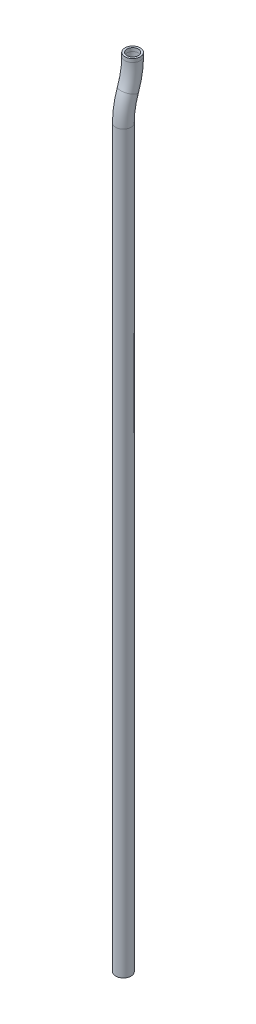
ISO-10303-21;
HEADER;
FILE_DESCRIPTION(('STEP AP214'),'2;1');
FILE_NAME('part.step','',(''),(''),'','','');
FILE_SCHEMA(('AUTOMOTIVE_DESIGN { 1 0 10303 214 1 1 1 1 }'));
ENDSEC;
DATA;
#1=APPLICATION_CONTEXT('core data for automotive mechanical design processes');
#2=APPLICATION_PROTOCOL_DEFINITION('international standard','automotive_design',2000,#1);
#3=PRODUCT_CONTEXT('',#1,'mechanical');
#4=PRODUCT('Part','Part','',(#3));
#5=PRODUCT_RELATED_PRODUCT_CATEGORY('part','',(#4));
#6=PRODUCT_DEFINITION_FORMATION('','',#4);
#7=PRODUCT_DEFINITION_CONTEXT('part definition',#1,'design');
#8=PRODUCT_DEFINITION('design','',#6,#7);
#9=PRODUCT_DEFINITION_SHAPE('','',#8);
#10=(LENGTH_UNIT() NAMED_UNIT(*) SI_UNIT(.MILLI.,.METRE.));
#11=(NAMED_UNIT(*) PLANE_ANGLE_UNIT() SI_UNIT($,.RADIAN.));
#12=(NAMED_UNIT(*) SI_UNIT($,.STERADIAN.) SOLID_ANGLE_UNIT());
#13=UNCERTAINTY_MEASURE_WITH_UNIT(LENGTH_MEASURE(1.E-05),#10,'distance_accuracy_value','');
#14=(GEOMETRIC_REPRESENTATION_CONTEXT(3) GLOBAL_UNCERTAINTY_ASSIGNED_CONTEXT((#13)) GLOBAL_UNIT_ASSIGNED_CONTEXT((#10,
#11,#12)) REPRESENTATION_CONTEXT('',''));
#15=CARTESIAN_POINT('',(0.,0.,0.));
#16=DIRECTION('',(0.,0.,1.));
#17=DIRECTION('',(1.,0.,0.));
#18=AXIS2_PLACEMENT_3D('',#15,#16,#17);
#19=CARTESIAN_POINT('',(0.,-54.6,-7.5));
#20=DIRECTION('',(0.,1.,0.));
#21=DIRECTION('',(0.,0.,1.));
#22=AXIS2_PLACEMENT_3D('',#19,#20,#21);
#23=CYLINDRICAL_SURFACE('',#22,1.85);
#24=CARTESIAN_POINT('',(0.,-54.6,-7.5));
#25=DIRECTION('',(0.,-1.,0.));
#26=DIRECTION('',(0.,0.,-1.));
#27=AXIS2_PLACEMENT_3D('',#24,#25,#26);
#28=CIRCLE('',#27,1.85);
#29=CARTESIAN_POINT('',(0.,-54.6,-5.65));
#30=VERTEX_POINT('',#29);
#31=EDGE_CURVE('E124',#30,#30,#28,.T.);
#32=ORIENTED_EDGE('',*,*,#31,.T.);
#33=DIRECTION('',(0.,1.,0.));
#34=VECTOR('',#33,1.);
#35=CARTESIAN_POINT('',(0.,-54.6,-5.65));
#36=LINE('',#35,#34);
#37=CARTESIAN_POINT('',(0.,-53.5,-5.65));
#38=VERTEX_POINT('',#37);
#39=EDGE_CURVE('E10',#30,#38,#36,.T.);
#40=ORIENTED_EDGE('',*,*,#39,.T.);
#41=CARTESIAN_POINT('',(0.,-53.5,-7.5));
#42=DIRECTION('',(0.,1.,0.));
#43=DIRECTION('',(0.,0.,1.));
#44=AXIS2_PLACEMENT_3D('',#41,#42,#43);
#45=CIRCLE('',#44,1.85);
#46=EDGE_CURVE('E27',#38,#38,#45,.T.);
#47=ORIENTED_EDGE('',*,*,#46,.T.);
#48=ORIENTED_EDGE('',*,*,#39,.F.);
#49=EDGE_LOOP('',(#32,#40,#47,#48));
#50=FACE_BOUND('',#49,.T.);
#51=ADVANCED_FACE('F16',(#50),#23,.F.);
#52=CARTESIAN_POINT('',(0.,-53.5,-7.5));
#53=DIRECTION('',(0.,1.,0.));
#54=DIRECTION('',(0.,0.,-1.));
#55=AXIS2_PLACEMENT_3D('',#52,#53,#54);
#56=PLANE('',#55);
#57=ORIENTED_EDGE('',*,*,#46,.F.);
#58=EDGE_LOOP('',(#57));
#59=FACE_BOUND('',#58,.T.);
#60=CARTESIAN_POINT('',(0.,-53.5,-7.5));
#61=DIRECTION('',(0.,1.,0.));
#62=DIRECTION('',(0.,0.,1.));
#63=AXIS2_PLACEMENT_3D('',#60,#61,#62);
#64=CIRCLE('',#63,2.5);
#65=CARTESIAN_POINT('',(0.,-53.5,-5.));
#66=VERTEX_POINT('',#65);
#67=EDGE_CURVE('E126',#66,#66,#64,.T.);
#68=ORIENTED_EDGE('',*,*,#67,.T.);
#69=EDGE_LOOP('',(#68));
#70=FACE_BOUND('',#69,.T.);
#71=ADVANCED_FACE('F217',(#59,#70),#56,.T.);
#72=CARTESIAN_POINT('',(0.,-54.6,17.903333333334));
#73=DIRECTION('',(1.,0.,0.));
#74=DIRECTION('',(0.,-0.338538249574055,-0.940952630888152));
#75=AXIS2_PLACEMENT_3D('',#72,#73,#74);
#76=TOROIDAL_SURFACE('',#75,25.403333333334,1.85);
#77=CARTESIAN_POINT('',(0.,-63.2,-6.));
#78=DIRECTION('',(0.,-0.940952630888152,0.338538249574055));
#79=DIRECTION('',(0.,0.338538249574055,0.940952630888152));
#80=AXIS2_PLACEMENT_3D('',#77,#78,#79);
#81=CIRCLE('',#80,1.85);
#82=CARTESIAN_POINT('',(0.,-62.57370423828,-4.259237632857));
#83=VERTEX_POINT('',#82);
#84=EDGE_CURVE('E112',#83,#83,#81,.T.);
#85=ORIENTED_EDGE('',*,*,#84,.T.);
#86=CARTESIAN_POINT('',(0.,-54.6,17.903333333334));
#87=DIRECTION('',(1.,0.,0.));
#88=DIRECTION('',(0.,-0.338538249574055,-0.940952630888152));
#89=AXIS2_PLACEMENT_3D('',#86,#87,#88);
#90=CIRCLE('',#89,23.553333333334);
#91=EDGE_CURVE('E127',#83,#30,#90,.T.);
#92=ORIENTED_EDGE('',*,*,#91,.T.);
#93=ORIENTED_EDGE('',*,*,#31,.F.);
#94=ORIENTED_EDGE('',*,*,#91,.F.);
#95=EDGE_LOOP('',(#85,#92,#93,#94));
#96=FACE_BOUND('',#95,.T.);
#97=ADVANCED_FACE('F200',(#96),#76,.F.);
#98=CARTESIAN_POINT('',(0.,-54.6,-7.5));
#99=DIRECTION('',(0.,1.,0.));
#100=DIRECTION('',(0.,0.,1.));
#101=AXIS2_PLACEMENT_3D('',#98,#99,#100);
#102=CYLINDRICAL_SURFACE('',#101,2.5);
#103=DIRECTION('',(0.,1.,0.));
#104=VECTOR('',#103,1.);
#105=CARTESIAN_POINT('',(0.,-54.6,-5.));
#106=LINE('',#105,#104);
#107=CARTESIAN_POINT('',(0.,-54.6,-5.));
#108=VERTEX_POINT('',#107);
#109=EDGE_CURVE('E94',#108,#66,#106,.T.);
#110=ORIENTED_EDGE('',*,*,#109,.T.);
#111=ORIENTED_EDGE('',*,*,#67,.F.);
#112=ORIENTED_EDGE('',*,*,#109,.F.);
#113=CARTESIAN_POINT('',(0.,-54.6,-7.5));
#114=DIRECTION('',(0.,-1.,0.));
#115=DIRECTION('',(0.,0.,-1.));
#116=AXIS2_PLACEMENT_3D('',#113,#114,#115);
#117=CIRCLE('',#116,2.5);
#118=EDGE_CURVE('E102',#108,#108,#117,.T.);
#119=ORIENTED_EDGE('',*,*,#118,.F.);
#120=EDGE_LOOP('',(#110,#111,#112,#119));
#121=FACE_BOUND('',#120,.T.);
#122=ADVANCED_FACE('F138',(#121),#102,.T.);
#123=CARTESIAN_POINT('',(0.,-71.8,-29.90333333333));
#124=DIRECTION('',(-1.,0.,0.));
#125=DIRECTION('',(0.,0.,1.));
#126=AXIS2_PLACEMENT_3D('',#123,#124,#125);
#127=TOROIDAL_SURFACE('',#126,25.403333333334,1.85);
#128=CARTESIAN_POINT('',(0.,-71.8,-4.5));
#129=DIRECTION('',(0.,1.,0.));
#130=DIRECTION('',(0.,0.,1.));
#131=AXIS2_PLACEMENT_3D('',#128,#129,#130);
#132=CIRCLE('',#131,1.85);
#133=CARTESIAN_POINT('',(0.,-71.8,-2.65));
#134=VERTEX_POINT('',#133);
#135=EDGE_CURVE('E96',#134,#134,#132,.T.);
#136=ORIENTED_EDGE('',*,*,#135,.F.);
#137=CARTESIAN_POINT('',(0.,-71.8,-29.90333333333));
#138=DIRECTION('',(-1.,0.,0.));
#139=DIRECTION('',(0.,0.,1.));
#140=AXIS2_PLACEMENT_3D('',#137,#138,#139);
#141=CIRCLE('',#140,27.253333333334);
#142=EDGE_CURVE('E105',#134,#83,#141,.T.);
#143=ORIENTED_EDGE('',*,*,#142,.T.);
#144=ORIENTED_EDGE('',*,*,#84,.F.);
#145=ORIENTED_EDGE('',*,*,#142,.F.);
#146=EDGE_LOOP('',(#136,#143,#144,#145));
#147=FACE_BOUND('',#146,.T.);
#148=ADVANCED_FACE('F201',(#147),#127,.F.);
#149=CARTESIAN_POINT('',(0.,-54.6,17.903333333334));
#150=DIRECTION('',(1.,0.,0.));
#151=DIRECTION('',(0.,-0.338538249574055,-0.940952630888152));
#152=AXIS2_PLACEMENT_3D('',#149,#150,#151);
#153=TOROIDAL_SURFACE('',#152,25.403333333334,2.5);
#154=CARTESIAN_POINT('',(0.,-54.6,17.903333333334));
#155=DIRECTION('',(1.,0.,0.));
#156=DIRECTION('',(0.,-0.338538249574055,-0.940952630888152));
#157=AXIS2_PLACEMENT_3D('',#154,#155,#156);
#158=CIRCLE('',#157,22.903333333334);
#159=CARTESIAN_POINT('',(0.,-62.35365437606,-3.647618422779));
#160=VERTEX_POINT('',#159);
#161=EDGE_CURVE('E99',#160,#108,#158,.T.);
#162=ORIENTED_EDGE('',*,*,#161,.T.);
#163=ORIENTED_EDGE('',*,*,#118,.T.);
#164=ORIENTED_EDGE('',*,*,#161,.F.);
#165=CARTESIAN_POINT('',(0.,-63.2,-6.));
#166=DIRECTION('',(0.,-0.940952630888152,0.338538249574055));
#167=DIRECTION('',(0.,0.338538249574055,0.940952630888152));
#168=AXIS2_PLACEMENT_3D('',#165,#166,#167);
#169=CIRCLE('',#168,2.5);
#170=EDGE_CURVE('E183',#160,#160,#169,.T.);
#171=ORIENTED_EDGE('',*,*,#170,.F.);
#172=EDGE_LOOP('',(#162,#163,#164,#171));
#173=FACE_BOUND('',#172,.T.);
#174=ADVANCED_FACE('F181',(#173),#153,.T.);
#175=CARTESIAN_POINT('',(0.,-310.,-4.5));
#176=DIRECTION('',(0.,1.,0.));
#177=DIRECTION('',(0.,0.,1.));
#178=AXIS2_PLACEMENT_3D('',#175,#176,#177);
#179=CYLINDRICAL_SURFACE('',#178,1.85);
#180=CARTESIAN_POINT('',(0.,-310.,-4.5));
#181=DIRECTION('',(0.,1.,0.));
#182=DIRECTION('',(0.,0.,1.));
#183=AXIS2_PLACEMENT_3D('',#180,#181,#182);
#184=CIRCLE('',#183,1.85);
#185=CARTESIAN_POINT('',(0.,-310.,-2.65));
#186=VERTEX_POINT('',#185);
#187=EDGE_CURVE('E79',#186,#186,#184,.T.);
#188=ORIENTED_EDGE('',*,*,#187,.F.);
#189=DIRECTION('',(0.,1.,0.));
#190=VECTOR('',#189,1.);
#191=CARTESIAN_POINT('',(0.,-310.,-2.65));
#192=LINE('',#191,#190);
#193=EDGE_CURVE('E20',#186,#134,#192,.T.);
#194=ORIENTED_EDGE('',*,*,#193,.T.);
#195=ORIENTED_EDGE('',*,*,#135,.T.);
#196=ORIENTED_EDGE('',*,*,#193,.F.);
#197=EDGE_LOOP('',(#188,#194,#195,#196));
#198=FACE_BOUND('',#197,.T.);
#199=ADVANCED_FACE('F204',(#198),#179,.F.);
#200=CARTESIAN_POINT('',(0.,-71.8,-29.90333333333));
#201=DIRECTION('',(-1.,0.,0.));
#202=DIRECTION('',(0.,0.,1.));
#203=AXIS2_PLACEMENT_3D('',#200,#201,#202);
#204=TOROIDAL_SURFACE('',#203,25.403333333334,2.5);
#205=CARTESIAN_POINT('',(0.,-71.8,-29.90333333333));
#206=DIRECTION('',(-1.,0.,0.));
#207=DIRECTION('',(0.,0.,1.));
#208=AXIS2_PLACEMENT_3D('',#205,#206,#207);
#209=CIRCLE('',#208,27.903333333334);
#210=CARTESIAN_POINT('',(0.,-71.8,-2.));
#211=VERTEX_POINT('',#210);
#212=EDGE_CURVE('E87',#211,#160,#209,.T.);
#213=ORIENTED_EDGE('',*,*,#212,.T.);
#214=ORIENTED_EDGE('',*,*,#170,.T.);
#215=ORIENTED_EDGE('',*,*,#212,.F.);
#216=CARTESIAN_POINT('',(0.,-71.8,-4.5));
#217=DIRECTION('',(0.,1.,0.));
#218=DIRECTION('',(0.,0.,1.));
#219=AXIS2_PLACEMENT_3D('',#216,#217,#218);
#220=CIRCLE('',#219,2.5);
#221=EDGE_CURVE('E80',#211,#211,#220,.T.);
#222=ORIENTED_EDGE('',*,*,#221,.T.);
#223=EDGE_LOOP('',(#213,#214,#215,#222));
#224=FACE_BOUND('',#223,.T.);
#225=ADVANCED_FACE('F18',(#224),#204,.T.);
#226=CARTESIAN_POINT('',(0.,-310.,-4.5));
#227=DIRECTION('',(0.,1.,0.));
#228=DIRECTION('',(0.,0.,-1.));
#229=AXIS2_PLACEMENT_3D('',#226,#227,#228);
#230=PLANE('',#229);
#231=ORIENTED_EDGE('',*,*,#187,.T.);
#232=EDGE_LOOP('',(#231));
#233=FACE_BOUND('',#232,.T.);
#234=CARTESIAN_POINT('',(0.,-310.,-4.5));
#235=DIRECTION('',(0.,1.,0.));
#236=DIRECTION('',(0.,0.,1.));
#237=AXIS2_PLACEMENT_3D('',#234,#235,#236);
#238=CIRCLE('',#237,2.5);
#239=CARTESIAN_POINT('',(0.,-310.,-2.));
#240=VERTEX_POINT('',#239);
#241=EDGE_CURVE('E73',#240,#240,#238,.T.);
#242=ORIENTED_EDGE('',*,*,#241,.F.);
#243=EDGE_LOOP('',(#242));
#244=FACE_BOUND('',#243,.T.);
#245=ADVANCED_FACE('F206',(#233,#244),#230,.F.);
#246=CARTESIAN_POINT('',(0.,-310.,-4.5));
#247=DIRECTION('',(0.,1.,0.));
#248=DIRECTION('',(0.,0.,1.));
#249=AXIS2_PLACEMENT_3D('',#246,#247,#248);
#250=CYLINDRICAL_SURFACE('',#249,2.5);
#251=DIRECTION('',(0.,1.,0.));
#252=VECTOR('',#251,1.);
#253=CARTESIAN_POINT('',(0.,-310.,-2.));
#254=LINE('',#253,#252);
#255=EDGE_CURVE('E76',#240,#211,#254,.T.);
#256=ORIENTED_EDGE('',*,*,#255,.T.);
#257=ORIENTED_EDGE('',*,*,#221,.F.);
#258=ORIENTED_EDGE('',*,*,#255,.F.);
#259=ORIENTED_EDGE('',*,*,#241,.T.);
#260=EDGE_LOOP('',(#256,#257,#258,#259));
#261=FACE_BOUND('',#260,.T.);
#262=ADVANCED_FACE('F74',(#261),#250,.T.);
#263=CLOSED_SHELL('',(#51,#71,#97,#122,#148,#174,#199,#225,#245,#262));
#264=MANIFOLD_SOLID_BREP('B1',#263);
#265=ADVANCED_BREP_SHAPE_REPRESENTATION('',(#18,#264),#14);
#266=SHAPE_DEFINITION_REPRESENTATION(#9,#265);
ENDSEC;
END-ISO-10303-21;
